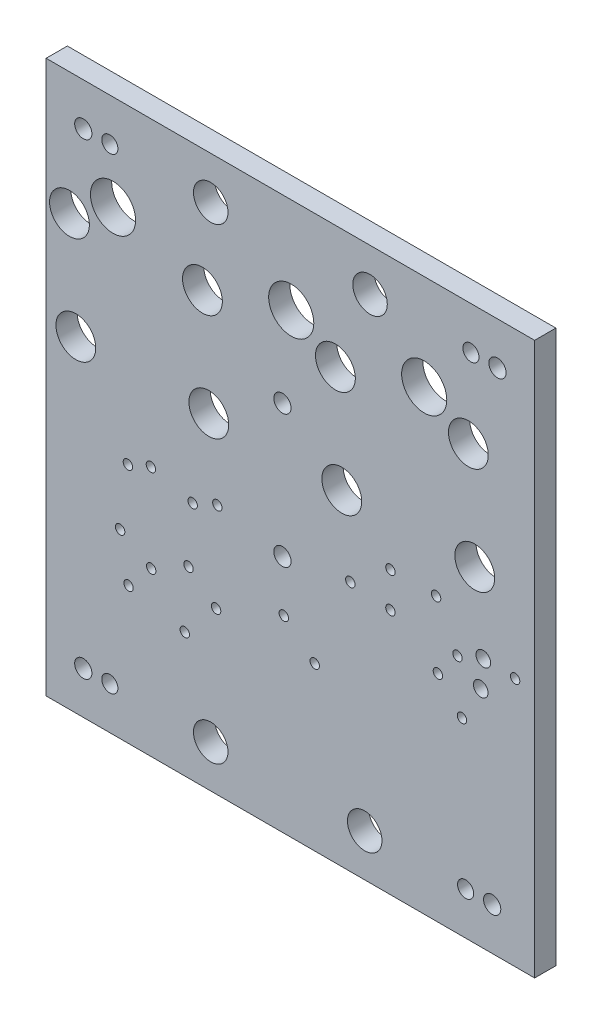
from build123d import *

# Parameters (mm, degrees)
SKETCH1_W           = 292.1
SKETCH1_H           = 330.2
BOSS_EXTRUDE1_DEPTH = 12.7
HOLE1_D             = 26.9875
HOLE11_D            = 23.8125
HOLE12_D            = 5.6134
HOLE13_D            = 5.6134
HOLE14_D            = 5.6134
HOLE15_D            = 5.6134
HOLE16_D            = 5.6134
HOLE17_D            = 5.6134
HOLE18_D            = 5.6134
HOLE19_D            = 5.6134
HOLE110_D           = 10.3124
HOLE111_D           = 20.6375
HOLE112_D           = 9.652
HOLE113_D           = 8.73125


with BuildPart() as part:
    # Sketch1 → Boss-Extrude1 (new body)
    with BuildSketch(Plane.XY):
        with Locations((-598.17, -15.875)):
            Rectangle(SKETCH1_W, SKETCH1_H)
    extrude(amount=BOSS_EXTRUDE1_DEPTH)

    # Hole1 (through all)
    with Locations(Plane(origin=(-426.246760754, 98.135890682, 12.7), x_dir=(1, 0, 0), z_dir=(0, 0, 1))):
        with Locations((-91.913239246, -6.060890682), (-171.415239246, -6.060890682), (-277.968239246, -6.060890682)):
            Hole(HOLE1_D / 2)

    # Hole11 (through all)
    with Locations(Plane(origin=(-488.089739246, 86.496340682, 0), x_dir=(-1, 0, 0), z_dir=(0, 0, -1))):
        with Locations((3.654260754, -10.601140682), (79.346260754, -72.526340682), (83.156260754, -10.601140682), (162.658260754, -10.601140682), (158.848260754, -72.526340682), (242.160260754, -10.601140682), (238.350260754, -72.526340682), (-0.155739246, -72.526340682)):
            Hole(HOLE11_D / 2)

    # Hole12 (through all)
    with Locations(Plane(origin=(-501.896031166, -26.59525055, 12.7), x_dir=(1, 0, 0), z_dir=(0, 0, 1))):
        with Locations((3.654260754, -10.601140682), (-8.074090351, -25.612745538)):
            Hole(HOLE12_D / 2)

    # Hole13 (through all)
    with Locations(Plane(origin=(-542.00041276, -2.046699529, 12.7), x_dir=(1, 0, 0), z_dir=(0, 0, 1))):
        with Locations((3.654260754, -10.601140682), (3.654260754, -31.556140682), (30.959260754, -10.601140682)):
            Hole(HOLE13_D / 2)

    # Hole14 (through all)
    with Locations(Plane(origin=(-605.768184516, -57.756677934, 12.7), x_dir=(1, 0, 0), z_dir=(0, 0, 1))):
        with Locations((3.662424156, -10.591411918), (22.147076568, -26.101876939), (43.444388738, 26.748085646)):
            Hole(HOLE14_D / 2)

    # Hole15 (through all)
    with Locations(Plane(origin=(-664.964981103, -95.840484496, 12.7), x_dir=(1, 0, 0), z_dir=(0, 0, 1))):
        with Locations((3.654260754, -10.601140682), (22.390606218, 10.973844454)):
            Hole(HOLE15_D / 2)

    # Hole16 (through all)
    with Locations(Plane(origin=(-662.725613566, -60.818926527, 12.7), x_dir=(1, 0, 0), z_dir=(0, 0, 1))):
        with Locations((3.654260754, -10.601140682), (6.135613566, 23.489053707), (20.899817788, 29.810334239)):
            Hole(HOLE16_D / 2)

    # Hole17 (through all)
    with Locations(Plane(origin=(-685.051452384, -72.968995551, 12.7), x_dir=(1, 0, 0), z_dir=(0, 0, 1))):
        with Locations((3.654260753, -10.601140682), (-9.877544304, -26.183074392)):
            Hole(HOLE17_D / 2)

    # Hole18 (through all)
    with Locations(Plane(origin=(-698.979260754, -26.093732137, 12.7), x_dir=(1, 0, 0), z_dir=(0, 0, 1))):
        with Locations((3.654260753, -10.601140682), (17.402464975, -4.91486015), (-0.99041688, -46.516632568)):
            Hole(HOLE18_D / 2)

    # Hole19 (through all)
    with Locations(Plane(origin=(-497.044693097, -55.819618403, 12.7), x_dir=(1, 0, 0), z_dir=(0, 0, 1))):
        with Locations((1.476000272, -12.208748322), (33.249454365, 24.069618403)):
            Hole(HOLE19_D / 2)

    # Hole110 (through all)
    with Locations(Plane(origin=(-477.999260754, -144.973859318, 12.7), x_dir=(1, 0, 0), z_dir=(0, 0, 1))):
        with Locations((0.479260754, -10.601140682), (3.654260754, 268.798859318), (-243.995739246, 268.798859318), (-243.995739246, -10.601140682), (-124.933239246, 186.248859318), (-124.933239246, 106.873859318)):
            Hole(HOLE110_D / 2)

    # Hole111 (through all)
    with Locations(Plane(origin=(-665.324260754, 134.426140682, 12.7), x_dir=(1, 0, 0), z_dir=(0, 0, 1))):
        with Locations((19.529260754, -10.601140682), (114.779260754, -10.601140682), (111.604260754, -290.001140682), (19.529260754, -290.001140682)):
            Hole(HOLE111_D / 2)

    # Hole112 (through all)
    with Locations(Plane(origin=(-492.915739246, -144.973859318, 0), x_dir=(-1, 0, 0), z_dir=(0, 0, -1))):
        with Locations((0.479260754, -10.601140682), (213.204260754, -10.601140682), (213.204260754, 268.798859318), (-2.695739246, 268.798859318)):
            Hole(HOLE112_D / 2)

    # Hole113 (through all)
    with Locations(Plane(origin=(-488.001042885, -36.325889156, 12.7), x_dir=(1, 0, 0), z_dir=(0, 0, 1))):
        with Locations((3.654260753, -10.973552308), (5.179247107, 5.317296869)):
            Hole(HOLE113_D / 2)


solid = part.part
